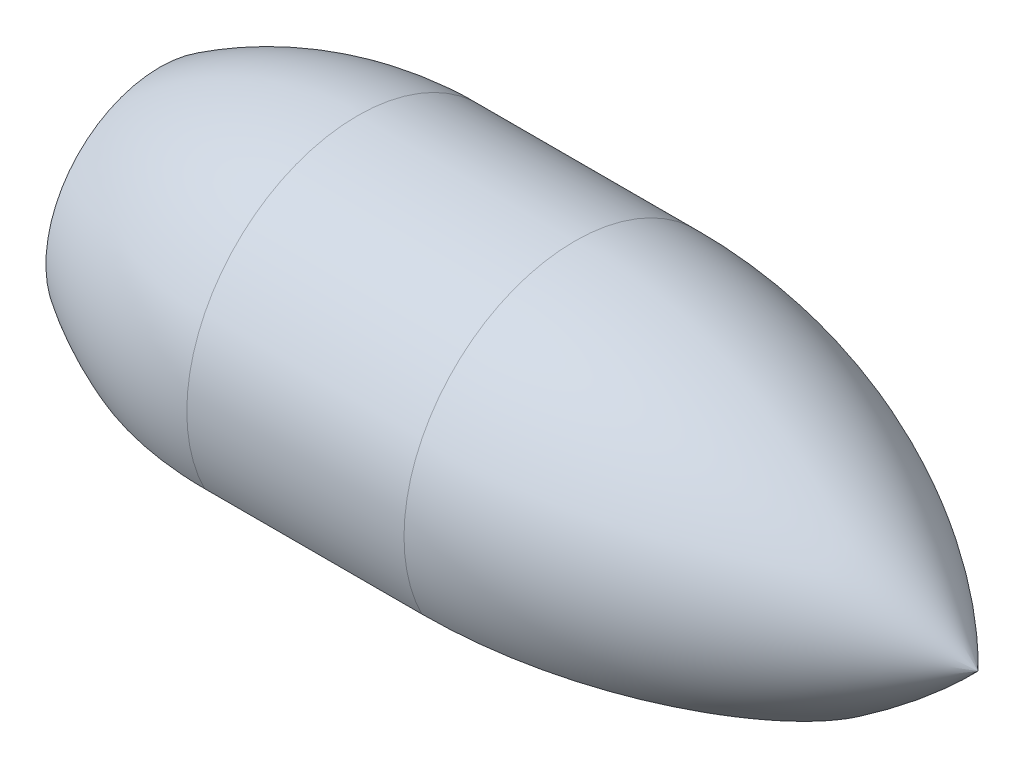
ISO-10303-21;
HEADER;
FILE_DESCRIPTION(('STEP AP214'),'2;1');
FILE_NAME('part.step','',(''),(''),'','','');
FILE_SCHEMA(('AUTOMOTIVE_DESIGN { 1 0 10303 214 1 1 1 1 }'));
ENDSEC;
DATA;
#1=APPLICATION_CONTEXT('core data for automotive mechanical design processes');
#2=APPLICATION_PROTOCOL_DEFINITION('international standard','automotive_design',2000,#1);
#3=PRODUCT_CONTEXT('',#1,'mechanical');
#4=PRODUCT('Part','Part','',(#3));
#5=PRODUCT_RELATED_PRODUCT_CATEGORY('part','',(#4));
#6=PRODUCT_DEFINITION_FORMATION('','',#4);
#7=PRODUCT_DEFINITION_CONTEXT('part definition',#1,'design');
#8=PRODUCT_DEFINITION('design','',#6,#7);
#9=PRODUCT_DEFINITION_SHAPE('','',#8);
#10=(LENGTH_UNIT() NAMED_UNIT(*) SI_UNIT(.MILLI.,.METRE.));
#11=(NAMED_UNIT(*) PLANE_ANGLE_UNIT() SI_UNIT($,.RADIAN.));
#12=(NAMED_UNIT(*) SI_UNIT($,.STERADIAN.) SOLID_ANGLE_UNIT());
#13=UNCERTAINTY_MEASURE_WITH_UNIT(LENGTH_MEASURE(1.E-05),#10,'distance_accuracy_value','');
#14=(GEOMETRIC_REPRESENTATION_CONTEXT(3) GLOBAL_UNCERTAINTY_ASSIGNED_CONTEXT((#13)) GLOBAL_UNIT_ASSIGNED_CONTEXT((#10,
#11,#12)) REPRESENTATION_CONTEXT('',''));
#15=CARTESIAN_POINT('',(0.,0.,0.));
#16=DIRECTION('',(0.,0.,1.));
#17=DIRECTION('',(1.,0.,0.));
#18=AXIS2_PLACEMENT_3D('',#15,#16,#17);
#19=CARTESIAN_POINT('',(87.63,0.,0.));
#20=DIRECTION('',(-1.,0.,0.));
#21=DIRECTION('',(0.,0.,1.));
#22=AXIS2_PLACEMENT_3D('',#19,#20,#21);
#23=CYLINDRICAL_SURFACE('',#22,18.288);
#24=CARTESIAN_POINT('',(44.45,0.,0.));
#25=DIRECTION('',(-1.,0.,0.));
#26=DIRECTION('',(0.,0.,1.));
#27=AXIS2_PLACEMENT_3D('',#24,#25,#26);
#28=CIRCLE('',#27,18.288);
#29=CARTESIAN_POINT('',(44.4499999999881,-8.10299076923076,16.3948920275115));
#30=VERTEX_POINT('',#29);
#31=CARTESIAN_POINT('',(44.45,-8.10299076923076,-16.3948920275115));
#32=VERTEX_POINT('',#31);
#33=EDGE_CURVE('E70',#30,#32,#28,.T.);
#34=ORIENTED_EDGE('',*,*,#33,.T.);
#35=DIRECTION('',(-1.,0.,0.));
#36=VECTOR('',#35,1.);
#37=CARTESIAN_POINT('',(87.63,-8.10299076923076,-16.3948920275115));
#38=LINE('',#37,#36);
#39=CARTESIAN_POINT('',(21.1848567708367,-8.10299076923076,-16.3948920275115));
#40=VERTEX_POINT('',#39);
#41=EDGE_CURVE('E46',#32,#40,#38,.T.);
#42=ORIENTED_EDGE('',*,*,#41,.T.);
#43=CARTESIAN_POINT('',(21.1848567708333,0.,0.));
#44=DIRECTION('',(-1.,0.,0.));
#45=DIRECTION('',(0.,0.,1.));
#46=AXIS2_PLACEMENT_3D('',#43,#44,#45);
#47=CIRCLE('',#46,18.288);
#48=CARTESIAN_POINT('',(21.1848567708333,-8.10299076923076,16.3948920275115));
#49=VERTEX_POINT('',#48);
#50=EDGE_CURVE('E72',#49,#40,#47,.T.);
#51=ORIENTED_EDGE('',*,*,#50,.F.);
#52=DIRECTION('',(-1.,0.,0.));
#53=VECTOR('',#52,1.);
#54=CARTESIAN_POINT('',(87.63,-8.10299076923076,16.3948920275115));
#55=LINE('',#54,#53);
#56=EDGE_CURVE('E63',#30,#49,#55,.T.);
#57=ORIENTED_EDGE('',*,*,#56,.F.);
#58=EDGE_LOOP('',(#34,#42,#51,#57));
#59=FACE_BOUND('',#58,.T.);
#60=ADVANCED_FACE('F29',(#59),#23,.T.);
#61=CARTESIAN_POINT('',(21.1848567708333,0.,0.));
#62=DIRECTION('',(-1.,0.,0.));
#63=DIRECTION('',(0.,0.,1.));
#64=AXIS2_PLACEMENT_3D('',#61,#62,#63);
#65=DEGENERATE_TOROIDAL_SURFACE('',#64,21.5708724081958,39.8588724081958,.F.);
#66=CARTESIAN_POINT('',(0.,0.,0.));
#67=DIRECTION('',(-1.,0.,0.));
#68=DIRECTION('',(0.,0.,1.));
#69=AXIS2_PLACEMENT_3D('',#66,#67,#68);
#70=CIRCLE('',#69,12.192);
#71=CARTESIAN_POINT('',(0.,-8.10299076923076,9.10968740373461));
#72=VERTEX_POINT('',#71);
#73=CARTESIAN_POINT('',(0.,-8.10299076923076,-9.10968740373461));
#74=VERTEX_POINT('',#73);
#75=EDGE_CURVE('E40',#72,#74,#70,.T.);
#76=ORIENTED_EDGE('',*,*,#75,.F.);
#77=CARTESIAN_POINT('',(-5.42701189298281,-8.10299076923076,0.));
#78=CARTESIAN_POINT('',(-5.42700869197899,-8.10299076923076,0.205943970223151));
#79=CARTESIAN_POINT('',(-5.4182286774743,-8.10299076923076,0.411912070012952));
#80=CARTESIAN_POINT('',(-5.38341209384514,-8.10299076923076,0.82238598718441));
#81=CARTESIAN_POINT('',(-5.35737311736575,-8.10299076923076,1.02689159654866));
#82=CARTESIAN_POINT('',(-5.28888127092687,-8.10299076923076,1.43331077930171));
#83=CARTESIAN_POINT('',(-5.24641336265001,-8.10299076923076,1.63522180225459));
#84=CARTESIAN_POINT('',(-5.14631975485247,-8.10299076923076,2.03532453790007));
#85=CARTESIAN_POINT('',(-5.0886857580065,-8.10299076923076,2.23351415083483));
#86=CARTESIAN_POINT('',(-4.92986401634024,-8.10299076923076,2.71615463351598));
#87=CARTESIAN_POINT('',(-4.82086706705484,-8.10299076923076,2.99804648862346));
#88=CARTESIAN_POINT('',(-4.57830886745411,-8.10299076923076,3.55093535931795));
#89=CARTESIAN_POINT('',(-4.44474329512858,-8.10299076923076,3.82193044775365));
#90=CARTESIAN_POINT('',(-4.15682521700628,-8.10299076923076,4.35356873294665));
#91=CARTESIAN_POINT('',(-4.00241383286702,-8.10299076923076,4.61417979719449));
#92=CARTESIAN_POINT('',(-3.6765710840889,-8.10299076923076,5.12444316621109));
#93=CARTESIAN_POINT('',(-3.50514049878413,-8.10299076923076,5.37409597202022));
#94=CARTESIAN_POINT('',(-3.16772446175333,-8.10299076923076,5.83588178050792));
#95=CARTESIAN_POINT('',(-3.00323105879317,-8.10299076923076,6.04911211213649));
#96=CARTESIAN_POINT('',(-2.66441800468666,-8.10299076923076,6.46764330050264));
#97=CARTESIAN_POINT('',(-2.49009705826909,-8.10299076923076,6.67294310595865));
#98=CARTESIAN_POINT('',(-2.13277019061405,-8.10299076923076,7.07602297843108));
#99=CARTESIAN_POINT('',(-1.94975957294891,-8.10299076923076,7.2737988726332));
#100=CARTESIAN_POINT('',(-1.5761058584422,-8.10299076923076,7.66201950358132));
#101=CARTESIAN_POINT('',(-1.38546187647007,-8.10299076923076,7.85246338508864));
#102=CARTESIAN_POINT('',(-0.802796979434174,-8.10299076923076,8.41368328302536));
#103=CARTESIAN_POINT('',(-0.400493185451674,-8.10299076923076,8.7738459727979));
#104=CARTESIAN_POINT('',(0.426390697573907,-8.10299076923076,9.4672616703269));
#105=CARTESIAN_POINT('',(0.850967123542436,-8.10299076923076,9.80051908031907));
#106=CARTESIAN_POINT('',(1.6306677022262,-8.10299076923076,10.3760317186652));
#107=CARTESIAN_POINT('',(1.98232910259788,-8.10299076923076,10.6229990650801));
#108=CARTESIAN_POINT('',(2.69634719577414,-8.10299076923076,11.100978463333));
#109=CARTESIAN_POINT('',(3.05870497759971,-8.10299076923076,11.3319888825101));
#110=CARTESIAN_POINT('',(4.16036174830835,-8.10299076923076,12.001637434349));
#111=CARTESIAN_POINT('',(4.91409083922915,-8.10299076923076,12.4167807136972));
#112=CARTESIAN_POINT('',(6.45232530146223,-8.10299076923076,13.1852948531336));
#113=CARTESIAN_POINT('',(7.23683596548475,-8.10299076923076,13.5386550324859));
#114=CARTESIAN_POINT('',(8.8305753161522,-8.10299076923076,14.1838785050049));
#115=CARTESIAN_POINT('',(9.63979993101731,-8.10299076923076,14.4757518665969));
#116=CARTESIAN_POINT('',(11.2993947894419,-8.10299076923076,15.0049256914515));
#117=CARTESIAN_POINT('',(12.1502873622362,-8.10299076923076,15.2405857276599));
#118=CARTESIAN_POINT('',(13.8674437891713,-8.10299076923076,15.6469948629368));
#119=CARTESIAN_POINT('',(14.7337083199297,-8.10299076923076,15.8177410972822));
#120=CARTESIAN_POINT('',(16.4761855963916,-8.10299076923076,16.0940344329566));
#121=CARTESIAN_POINT('',(17.3523938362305,-8.10299076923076,16.1996099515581));
#122=CARTESIAN_POINT('',(19.109892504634,-8.10299076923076,16.3455005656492));
#123=CARTESIAN_POINT('',(19.991181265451,-8.10299076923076,16.385835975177));
#124=CARTESIAN_POINT('',(21.8632161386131,-8.10299076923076,16.4021722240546));
#125=CARTESIAN_POINT('',(22.8540622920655,-8.10299076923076,16.3696288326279));
#126=CARTESIAN_POINT('',(24.3354358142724,-8.10299076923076,16.259118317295));
#127=CARTESIAN_POINT('',(24.8284550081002,-8.10299076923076,16.2119919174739));
#128=CARTESIAN_POINT('',(25.8122572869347,-8.10299076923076,16.0971798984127));
#129=CARTESIAN_POINT('',(26.3030396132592,-8.10299076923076,16.0294877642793));
#130=CARTESIAN_POINT('',(27.7728851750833,-8.10299076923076,15.7952274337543));
#131=CARTESIAN_POINT('',(28.7471778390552,-8.10299076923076,15.5976439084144));
#132=CARTESIAN_POINT('',(30.6753914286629,-8.10299076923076,15.1202378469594));
#133=CARTESIAN_POINT('',(31.6293136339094,-8.10299076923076,14.8404204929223));
#134=CARTESIAN_POINT('',(33.0417954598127,-8.10299076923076,14.3583468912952));
#135=CARTESIAN_POINT('',(33.5109442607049,-8.10299076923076,14.1866507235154));
#136=CARTESIAN_POINT('',(34.4409874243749,-8.10299076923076,13.8225742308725));
#137=CARTESIAN_POINT('',(34.9018837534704,-8.10299076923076,13.6301989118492));
#138=CARTESIAN_POINT('',(36.2714193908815,-8.10299076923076,13.0216387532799));
#139=CARTESIAN_POINT('',(37.166542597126,-8.10299076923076,12.5741428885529));
#140=CARTESIAN_POINT('',(38.4711520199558,-8.10299076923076,11.8412746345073));
#141=CARTESIAN_POINT('',(38.8986643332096,-8.10299076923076,11.5874183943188));
#142=CARTESIAN_POINT('',(39.7405142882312,-8.10299076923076,11.0585167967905));
#143=CARTESIAN_POINT('',(40.1548508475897,-8.10299076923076,10.7834697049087));
#144=CARTESIAN_POINT('',(40.9678790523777,-8.10299076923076,10.2121272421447));
#145=CARTESIAN_POINT('',(41.366588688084,-8.10299076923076,9.9158574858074));
#146=CARTESIAN_POINT('',(42.1464369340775,-8.10299076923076,9.30115924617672));
#147=CARTESIAN_POINT('',(42.5275811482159,-8.10299076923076,8.98273791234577));
#148=CARTESIAN_POINT('',(43.1495002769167,-8.10299076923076,8.4292297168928));
#149=CARTESIAN_POINT('',(43.3958747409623,-8.10299076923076,8.20041788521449));
#150=CARTESIAN_POINT('',(43.877841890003,-8.10299076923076,7.73173917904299));
#151=CARTESIAN_POINT('',(44.1134362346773,-8.10299076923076,7.4918740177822));
#152=CARTESIAN_POINT('',(44.5727130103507,-8.10299076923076,7.00004837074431));
#153=CARTESIAN_POINT('',(44.7963702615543,-8.10299076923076,6.74806429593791));
#154=CARTESIAN_POINT('',(45.2291322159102,-8.10299076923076,6.23182387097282));
#155=CARTESIAN_POINT('',(45.4382363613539,-8.10299076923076,5.96756705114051));
#156=CARTESIAN_POINT('',(45.8416829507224,-8.10299076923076,5.42259098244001));
#157=CARTESIAN_POINT('',(46.0357979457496,-8.10299076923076,5.14170228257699));
#158=CARTESIAN_POINT('',(46.4023792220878,-8.10299076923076,4.56592255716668));
#159=CARTESIAN_POINT('',(46.5748405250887,-8.10299076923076,4.27102833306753));
#160=CARTESIAN_POINT('',(46.8923842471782,-8.10299076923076,3.66818342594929));
#161=CARTESIAN_POINT('',(47.0375709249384,-8.10299076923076,3.36028820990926));
#162=CARTESIAN_POINT('',(47.2950875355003,-8.10299076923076,2.73107507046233));
#163=CARTESIAN_POINT('',(47.4074467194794,-8.10299076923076,2.40976939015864));
#164=CARTESIAN_POINT('',(47.5582993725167,-8.10299076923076,1.87718571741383));
#165=CARTESIAN_POINT('',(47.6087355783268,-8.10299076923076,1.66926094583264));
#166=CARTESIAN_POINT('',(47.6924365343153,-8.10299076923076,1.24997148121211));
#167=CARTESIAN_POINT('',(47.725704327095,-8.10299076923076,1.03860740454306));
#168=CARTESIAN_POINT('',(47.7738797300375,-8.10299076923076,0.614025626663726));
#169=CARTESIAN_POINT('',(47.7888082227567,-8.10299076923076,0.400810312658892));
#170=CARTESIAN_POINT('',(47.7998129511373,-8.10299076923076,-0.0261183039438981));
#171=CARTESIAN_POINT('',(47.7958886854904,-8.10299076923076,-0.239831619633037));
#172=CARTESIAN_POINT('',(47.7693496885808,-8.10299076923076,-0.665879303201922));
#173=CARTESIAN_POINT('',(47.746752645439,-8.10299076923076,-0.878214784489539));
#174=CARTESIAN_POINT('',(47.683722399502,-8.10299076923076,-1.30019717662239));
#175=CARTESIAN_POINT('',(47.6432890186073,-8.10299076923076,-1.50984406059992));
#176=CARTESIAN_POINT('',(47.5458526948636,-8.10299076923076,-1.9255399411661));
#177=CARTESIAN_POINT('',(47.488825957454,-8.10299076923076,-2.13158331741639));
#178=CARTESIAN_POINT('',(47.3598322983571,-8.10299076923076,-2.53896253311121));
#179=CARTESIAN_POINT('',(47.287860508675,-8.10299076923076,-2.7402968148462));
#180=CARTESIAN_POINT('',(47.0874156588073,-8.10299076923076,-3.24704383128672));
#181=CARTESIAN_POINT('',(46.9496394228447,-8.10299076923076,-3.5487906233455));
#182=CARTESIAN_POINT('',(46.6480621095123,-8.10299076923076,-4.13898166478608));
#183=CARTESIAN_POINT('',(46.4842458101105,-8.10299076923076,-4.42741800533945));
#184=CARTESIAN_POINT('',(46.1349756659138,-8.10299076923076,-4.99181692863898));
#185=CARTESIAN_POINT('',(45.9494667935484,-8.10299076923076,-5.26774521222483));
#186=CARTESIAN_POINT('',(45.5609288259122,-8.10299076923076,-5.80685881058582));
#187=CARTESIAN_POINT('',(45.3579011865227,-8.10299076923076,-6.07004518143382));
#188=CARTESIAN_POINT('',(44.9578109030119,-8.10299076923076,-6.55911202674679));
#189=CARTESIAN_POINT('',(44.762117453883,-8.10299076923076,-6.78611919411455));
#190=CARTESIAN_POINT('',(44.3603607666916,-8.10299076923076,-7.2308064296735));
#191=CARTESIAN_POINT('',(44.1542958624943,-8.10299076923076,-7.44848498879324));
#192=CARTESIAN_POINT('',(43.732989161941,-8.10299076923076,-7.87498332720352));
#193=CARTESIAN_POINT('',(43.5177425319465,-8.10299076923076,-8.08379832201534));
#194=CARTESIAN_POINT('',(43.0791755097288,-8.10299076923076,-8.49278767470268));
#195=CARTESIAN_POINT('',(42.8558542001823,-8.10299076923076,-8.69296104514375));
#196=CARTESIAN_POINT('',(42.1745311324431,-8.10299076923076,-9.28138513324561));
#197=CARTESIAN_POINT('',(41.7056221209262,-8.10299076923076,-9.65708739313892));
#198=CARTESIAN_POINT('',(40.7440910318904,-8.10299076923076,-10.3764059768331));
#199=CARTESIAN_POINT('',(40.251472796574,-8.10299076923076,-10.7200274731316));
#200=CARTESIAN_POINT('',(39.3720449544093,-8.10299076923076,-11.2940127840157));
#201=CARTESIAN_POINT('',(38.9896528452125,-8.10299076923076,-11.5311808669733));
#202=CARTESIAN_POINT('',(38.2147468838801,-8.10299076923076,-11.988354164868));
#203=CARTESIAN_POINT('',(37.822232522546,-8.10299076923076,-12.2083585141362));
#204=CARTESIAN_POINT('',(36.630865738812,-8.10299076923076,-12.8430284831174));
#205=CARTESIAN_POINT('',(35.8183210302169,-8.10299076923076,-13.2322658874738));
#206=CARTESIAN_POINT('',(34.164624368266,-8.10299076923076,-13.9432023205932));
#207=CARTESIAN_POINT('',(33.3234813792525,-8.10299076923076,-14.2649222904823));
#208=CARTESIAN_POINT('',(32.0447747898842,-8.10299076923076,-14.697019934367));
#209=CARTESIAN_POINT('',(31.6156005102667,-8.10299076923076,-14.8326656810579));
#210=CARTESIAN_POINT('',(30.7521904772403,-8.10299076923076,-15.0871324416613));
#211=CARTESIAN_POINT('',(30.3179536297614,-8.10299076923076,-15.2059497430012));
#212=CARTESIAN_POINT('',(28.9944376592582,-8.10299076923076,-15.5407093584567));
#213=CARTESIAN_POINT('',(28.0983439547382,-8.10299076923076,-15.7302352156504));
#214=CARTESIAN_POINT('',(26.2941586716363,-8.10299076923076,-16.0392282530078));
#215=CARTESIAN_POINT('',(25.3860667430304,-8.10299076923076,-16.1586933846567));
#216=CARTESIAN_POINT('',(24.0192290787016,-8.10299076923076,-16.2852083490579));
#217=CARTESIAN_POINT('',(23.5627919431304,-8.10299076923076,-16.3186001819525));
#218=CARTESIAN_POINT('',(22.6490775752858,-8.10299076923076,-16.3678102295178));
#219=CARTESIAN_POINT('',(22.1918005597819,-8.10299076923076,-16.3836324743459));
#220=CARTESIAN_POINT('',(20.8193257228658,-8.10299076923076,-16.4047370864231));
#221=CARTESIAN_POINT('',(19.9035887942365,-8.10299076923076,-16.383647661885));
#222=CARTESIAN_POINT('',(17.9933396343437,-8.10299076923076,-16.2660481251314));
#223=CARTESIAN_POINT('',(16.9992438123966,-8.10299076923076,-16.1628479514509));
#224=CARTESIAN_POINT('',(15.0234826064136,-8.10299076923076,-15.8729887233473));
#225=CARTESIAN_POINT('',(14.0418130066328,-8.10299076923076,-15.6863587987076));
#226=CARTESIAN_POINT('',(12.5836084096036,-8.10299076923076,-15.3440088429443));
#227=CARTESIAN_POINT('',(12.0995932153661,-8.10299076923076,-15.2193833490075));
#228=CARTESIAN_POINT('',(11.1374887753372,-8.10299076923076,-14.9493733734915));
#229=CARTESIAN_POINT('',(10.6593985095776,-8.10299076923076,-14.803992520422));
#230=CARTESIAN_POINT('',(9.23552292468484,-8.10299076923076,-14.3367717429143));
#231=CARTESIAN_POINT('',(8.29969600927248,-8.10299076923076,-13.9837514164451));
#232=CARTESIAN_POINT('',(6.68107931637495,-8.10299076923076,-13.2881128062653));
#233=CARTESIAN_POINT('',(5.99078510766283,-8.10299076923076,-12.9627763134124));
#234=CARTESIAN_POINT('',(4.63516578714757,-8.10299076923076,-12.2633276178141));
#235=CARTESIAN_POINT('',(3.96984324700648,-8.10299076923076,-11.8892104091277));
#236=CARTESIAN_POINT('',(2.67162316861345,-8.10299076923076,-11.0927300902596));
#237=CARTESIAN_POINT('',(2.03862251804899,-8.10299076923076,-10.6705363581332));
#238=CARTESIAN_POINT('',(1.11717895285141,-8.10299076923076,-9.99930711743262));
#239=CARTESIAN_POINT('',(0.814765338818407,-8.10299076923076,-9.7692910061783));
#240=CARTESIAN_POINT('',(0.220287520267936,-8.10299076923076,-9.29617025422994));
#241=CARTESIAN_POINT('',(-0.0717762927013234,-8.10299076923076,-9.05306511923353));
#242=CARTESIAN_POINT('',(-0.624456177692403,-8.10299076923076,-8.5705260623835));
#243=CARTESIAN_POINT('',(-0.885853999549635,-8.10299076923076,-8.33198819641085));
#244=CARTESIAN_POINT('',(-1.39696897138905,-8.10299076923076,-7.84277065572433));
#245=CARTESIAN_POINT('',(-1.64668838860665,-8.10299076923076,-7.59209335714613));
#246=CARTESIAN_POINT('',(-2.13337175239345,-8.10299076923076,-7.07722512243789));
#247=CARTESIAN_POINT('',(-2.37029666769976,-8.10299076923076,-6.81299715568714));
#248=CARTESIAN_POINT('',(-2.82818225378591,-8.10299076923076,-6.27098227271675));
#249=CARTESIAN_POINT('',(-3.04914271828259,-8.10299076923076,-5.99319518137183));
#250=CARTESIAN_POINT('',(-3.4751721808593,-8.10299076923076,-5.41880226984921));
#251=CARTESIAN_POINT('',(-3.67993738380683,-8.10299076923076,-5.12196954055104));
#252=CARTESIAN_POINT('',(-4.06514916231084,-8.10299076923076,-4.512617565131));
#253=CARTESIAN_POINT('',(-4.24558714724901,-8.10299076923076,-4.20009283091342));
#254=CARTESIAN_POINT('',(-4.57503886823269,-8.10299076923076,-3.56102229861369));
#255=CARTESIAN_POINT('',(-4.7242284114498,-8.10299076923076,-3.23456810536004));
#256=CARTESIAN_POINT('',(-4.98489704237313,-8.10299076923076,-2.56704441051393));
#257=CARTESIAN_POINT('',(-5.09642863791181,-8.10299076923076,-2.22599601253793));
#258=CARTESIAN_POINT('',(-5.2245168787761,-8.10299076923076,-1.72587155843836));
#259=CARTESIAN_POINT('',(-5.2593551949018,-8.10299076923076,-1.5713603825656));
#260=CARTESIAN_POINT('',(-5.31957112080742,-8.10299076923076,-1.26051996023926));
#261=CARTESIAN_POINT('',(-5.34495112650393,-8.10299076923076,-1.10419118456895));
#262=CARTESIAN_POINT('',(-5.38577117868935,-8.10299076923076,-0.790210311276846));
#263=CARTESIAN_POINT('',(-5.40120956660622,-8.10299076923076,-0.632557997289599));
#264=CARTESIAN_POINT('',(-5.42183045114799,-8.10299076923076,-0.316608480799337));
#265=CARTESIAN_POINT('',(-5.42701435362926,-8.10299076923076,-0.158311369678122));
#266=CARTESIAN_POINT('',(-5.42701189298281,-8.10299076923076,0.));
#267=B_SPLINE_CURVE_WITH_KNOTS('',3,(#77,#78,#79,#80,#81,#82,#83,#84,#85,#86,#87,#88,#89,#90,
#91,#92,#93,#94,#95,#96,#97,#98,#99,#100,#101,#102,#103,#104,#105,#106,#107,#108,#109,#110,#111,
#112,#113,#114,#115,#116,#117,#118,#119,#120,#121,#122,#123,#124,#125,#126,#127,#128,#129,#130,
#131,#132,#133,#134,#135,#136,#137,#138,#139,#140,#141,#142,#143,#144,#145,#146,#147,#148,#149,
#150,#151,#152,#153,#154,#155,#156,#157,#158,#159,#160,#161,#162,#163,#164,#165,#166,#167,#168,
#169,#170,#171,#172,#173,#174,#175,#176,#177,#178,#179,#180,#181,#182,#183,#184,#185,#186,#187,
#188,#189,#190,#191,#192,#193,#194,#195,#196,#197,#198,#199,#200,#201,#202,#203,#204,#205,#206,
#207,#208,#209,#210,#211,#212,#213,#214,#215,#216,#217,#218,#219,#220,#221,#222,#223,#224,#225,
#226,#227,#228,#229,#230,#231,#232,#233,#234,#235,#236,#237,#238,#239,#240,#241,#242,#243,#244,
#245,#246,#247,#248,#249,#250,#251,#252,#253,#254,#255,#256,#257,#258,#259,#260,#261,#262,#263,
#264,#265,#266),.UNSPECIFIED.,.T.,.F.,(4,2,2,2,2,2,2,2,2,2,2,2,2,2,2,2,2,2,2,2,2,2,2,2,2,2,2,2,
2,2,2,2,2,2,2,2,2,2,2,2,2,2,2,2,2,2,2,2,2,2,2,2,2,2,2,2,2,2,2,2,2,2,2,2,2,2,2,2,2,2,2,2,2,2,2,2,
2,2,2,2,2,2,2,2,2,2,2,2,2,2,2,2,2,2,4),(0.,0.617690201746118,1.23546657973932,1.85380978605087,
2.47249199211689,3.37770207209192,4.28307154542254,5.19105390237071,6.09899470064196,
6.90659332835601,7.71429864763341,8.5224455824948,9.33068649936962,10.9491849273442,
12.567417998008,13.8561274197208,15.1449685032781,17.7232186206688,20.3019140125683,
22.8801868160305,25.5263888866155,28.172707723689,30.8178718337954,33.4622121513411,
36.432548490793,37.9179829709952,39.4038885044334,42.3825038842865,45.3609316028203,
46.8592211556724,48.3571488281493,51.3541495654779,52.8452856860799,54.3365439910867,
55.8260318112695,57.3150411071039,58.3234475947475,59.3316983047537,60.341997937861,
61.35233626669,62.3758194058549,63.399537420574,64.4192588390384,65.4380688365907,
66.0793081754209,66.7204338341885,67.3608287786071,68.0012407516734,68.6410467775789,
69.280859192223,69.9215936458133,70.5625371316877,71.5560294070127,72.5501045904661,
73.5467585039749,74.5433296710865,75.44212243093,76.3410600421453,77.2404768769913,
78.1399962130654,79.9409482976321,81.7416095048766,83.0910692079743,84.4405969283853,
87.1401205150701,89.8388055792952,91.1888066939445,92.5391051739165,95.2838792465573,
98.0287335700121,99.4014078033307,100.77376710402,103.518800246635,106.513685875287,
109.507526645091,111.006525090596,112.505261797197,115.501393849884,117.789004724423,
120.076850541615,122.356871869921,123.496424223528,124.636019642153,125.697290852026,
126.758355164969,127.822492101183,128.886642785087,129.967492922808,131.048723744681,
132.123697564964,133.197166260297,133.672097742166,134.146908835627,134.621799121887,
135.096624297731),.UNSPECIFIED.);
#268=EDGE_CURVE('E91',#72,#49,#267,.T.);
#269=ORIENTED_EDGE('',*,*,#268,.T.);
#270=ORIENTED_EDGE('',*,*,#50,.T.);
#271=EDGE_CURVE('E51',#40,#74,#267,.T.);
#272=ORIENTED_EDGE('',*,*,#271,.T.);
#273=EDGE_LOOP('',(#76,#269,#270,#272));
#274=FACE_BOUND('',#273,.T.);
#275=ADVANCED_FACE('F90',(#274),#65,.F.);
#276=CARTESIAN_POINT('',(0.,0.,0.));
#277=DIRECTION('',(1.,0.,0.));
#278=DIRECTION('',(0.,0.,-1.));
#279=AXIS2_PLACEMENT_3D('',#276,#277,#278);
#280=PLANE('',#279);
#281=CARTESIAN_POINT('',(0.,0.,0.));
#282=DIRECTION('',(-1.,0.,0.));
#283=DIRECTION('',(0.,0.,1.));
#284=AXIS2_PLACEMENT_3D('',#281,#282,#283);
#285=CIRCLE('',#284,7.9375);
#286=CARTESIAN_POINT('',(0.,0.,7.9375));
#287=VERTEX_POINT('',#286);
#288=EDGE_CURVE('E93',#287,#287,#285,.T.);
#289=ORIENTED_EDGE('',*,*,#288,.F.);
#290=EDGE_LOOP('',(#289));
#291=FACE_BOUND('',#290,.T.);
#292=ORIENTED_EDGE('',*,*,#75,.T.);
#293=DIRECTION('',(0.,0.,-1.));
#294=VECTOR('',#293,1.);
#295=CARTESIAN_POINT('',(0.,-8.10299076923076,16.3948920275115));
#296=LINE('',#295,#294);
#297=EDGE_CURVE('E73',#72,#74,#296,.T.);
#298=ORIENTED_EDGE('',*,*,#297,.F.);
#299=EDGE_LOOP('',(#292,#298));
#300=FACE_BOUND('',#299,.T.);
#301=ADVANCED_FACE('F88',(#291,#300),#280,.F.);
#302=CARTESIAN_POINT('',(44.45,0.,0.));
#303=DIRECTION('',(-1.,0.,0.));
#304=DIRECTION('',(0.,0.,1.));
#305=AXIS2_PLACEMENT_3D('',#302,#303,#304);
#306=DEGENERATE_TOROIDAL_SURFACE('',#305,41.8524678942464,60.1404678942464,.F.);
#307=CARTESIAN_POINT('',(77.9362364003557,-8.10299076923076,0.));
#308=CARTESIAN_POINT('',(77.9362404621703,-8.10299076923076,0.172813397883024));
#309=CARTESIAN_POINT('',(77.9279615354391,-8.10299076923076,0.345608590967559));
#310=CARTESIAN_POINT('',(77.8951998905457,-8.10299076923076,0.689708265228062));
#311=CARTESIAN_POINT('',(77.8707115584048,-8.10299076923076,0.861012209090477));
#312=CARTESIAN_POINT('',(77.8064399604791,-8.10299076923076,1.20096515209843));
#313=CARTESIAN_POINT('',(77.7666336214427,-8.10299076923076,1.369609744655));
#314=CARTESIAN_POINT('',(77.6731031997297,-8.10299076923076,1.70305657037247));
#315=CARTESIAN_POINT('',(77.6193708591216,-8.10299076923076,1.86785646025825));
#316=CARTESIAN_POINT('',(77.4773033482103,-8.10299076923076,2.25331748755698));
#317=CARTESIAN_POINT('',(77.383529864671,-8.10299076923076,2.47197521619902));
#318=CARTESIAN_POINT('',(77.1768384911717,-8.10299076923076,2.89999829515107));
#319=CARTESIAN_POINT('',(77.0639132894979,-8.10299076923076,3.10936005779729));
#320=CARTESIAN_POINT('',(76.8221912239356,-8.10299076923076,3.5193433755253));
#321=CARTESIAN_POINT('',(76.6933551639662,-8.10299076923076,3.71994162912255));
#322=CARTESIAN_POINT('',(76.4229727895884,-8.10299076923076,4.1122768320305));
#323=CARTESIAN_POINT('',(76.2814279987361,-8.10299076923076,4.30401483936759));
#324=CARTESIAN_POINT('',(75.9897825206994,-8.10299076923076,4.67688612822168));
#325=CARTESIAN_POINT('',(75.8398143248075,-8.10299076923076,4.85812363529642));
#326=CARTESIAN_POINT('',(75.5314234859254,-8.10299076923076,5.21322393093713));
#327=CARTESIAN_POINT('',(75.3730008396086,-8.10299076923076,5.38708671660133));
#328=CARTESIAN_POINT('',(75.0489005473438,-8.10299076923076,5.7281650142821));
#329=CARTESIAN_POINT('',(74.8832170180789,-8.10299076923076,5.89537491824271));
#330=CARTESIAN_POINT('',(74.5457418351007,-8.10299076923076,6.22352769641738));
#331=CARTESIAN_POINT('',(74.3739494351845,-8.10299076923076,6.38446979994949));
#332=CARTESIAN_POINT('',(73.8500106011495,-8.10299076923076,6.85920514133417));
#333=CARTESIAN_POINT('',(73.4899226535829,-8.10299076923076,7.16426548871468));
#334=CARTESIAN_POINT('',(72.7536581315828,-8.10299076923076,7.75383377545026));
#335=CARTESIAN_POINT('',(72.3774868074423,-8.10299076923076,8.03834834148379));
#336=CARTESIAN_POINT('',(71.5775861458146,-8.10299076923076,8.61384629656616));
#337=CARTESIAN_POINT('',(71.1526222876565,-8.10299076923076,8.90311017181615));
#338=CARTESIAN_POINT('',(70.2898402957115,-8.10299076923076,9.46188841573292));
#339=CARTESIAN_POINT('',(69.8520195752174,-8.10299076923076,9.73139877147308));
#340=CARTESIAN_POINT('',(68.9652416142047,-8.10299076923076,10.252191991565));
#341=CARTESIAN_POINT('',(68.5162760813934,-8.10299076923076,10.5034607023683));
#342=CARTESIAN_POINT('',(67.6090109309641,-8.10299076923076,10.9885472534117));
#343=CARTESIAN_POINT('',(67.1507108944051,-8.10299076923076,11.2223643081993));
#344=CARTESIAN_POINT('',(66.2255442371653,-8.10299076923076,11.6734651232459));
#345=CARTESIAN_POINT('',(65.7586703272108,-8.10299076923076,11.8907339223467));
#346=CARTESIAN_POINT('',(64.8177338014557,-8.10299076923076,12.3090240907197));
#347=CARTESIAN_POINT('',(64.343671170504,-8.10299076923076,12.5100454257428));
#348=CARTESIAN_POINT('',(62.9121659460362,-8.10299076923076,13.0892535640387));
#349=CARTESIAN_POINT('',(61.9450179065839,-8.10299076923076,13.4437723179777));
#350=CARTESIAN_POINT('',(60.2722644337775,-8.10299076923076,13.9981757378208));
#351=CARTESIAN_POINT('',(59.5715845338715,-8.10299076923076,14.2131846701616));
#352=CARTESIAN_POINT('',(58.1615548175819,-8.10299076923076,14.612591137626));
#353=CARTESIAN_POINT('',(57.4522053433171,-8.10299076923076,14.7969898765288));
#354=CARTESIAN_POINT('',(56.0260988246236,-8.10299076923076,15.1355166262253));
#355=CARTESIAN_POINT('',(55.3093395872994,-8.10299076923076,15.2896353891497));
#356=CARTESIAN_POINT('',(53.8698807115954,-8.10299076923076,15.5677447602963));
#357=CARTESIAN_POINT('',(53.1471797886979,-8.10299076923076,15.691728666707));
#358=CARTESIAN_POINT('',(50.9717874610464,-8.10299076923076,16.018689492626));
#359=CARTESIAN_POINT('',(49.5120876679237,-8.10299076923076,16.1766091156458));
#360=CARTESIAN_POINT('',(46.5846681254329,-8.10299076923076,16.3726233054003));
#361=CARTESIAN_POINT('',(45.1169481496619,-8.10299076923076,16.410714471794));
#362=CARTESIAN_POINT('',(42.9110450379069,-8.10299076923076,16.3779958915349));
#363=CARTESIAN_POINT('',(42.1719771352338,-8.10299076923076,16.3518184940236));
#364=CARTESIAN_POINT('',(40.6957326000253,-8.10299076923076,16.2690423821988));
#365=CARTESIAN_POINT('',(39.9585555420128,-8.10299076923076,16.2124512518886));
#366=CARTESIAN_POINT('',(37.7520730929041,-8.10299076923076,15.9970462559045));
#367=CARTESIAN_POINT('',(36.2869780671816,-8.10299076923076,15.7925884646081));
#368=CARTESIAN_POINT('',(33.3819873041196,-8.10299076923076,15.2617893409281));
#369=CARTESIAN_POINT('',(31.9420463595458,-8.10299076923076,14.9356968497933));
#370=CARTESIAN_POINT('',(29.808040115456,-8.10299076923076,14.3540463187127));
#371=CARTESIAN_POINT('',(29.1011126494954,-8.10299076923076,14.1447774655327));
#372=CARTESIAN_POINT('',(27.6973147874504,-8.10299076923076,13.6949495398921));
#373=CARTESIAN_POINT('',(27.0004431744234,-8.10299076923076,13.4543942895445));
#374=CARTESIAN_POINT('',(25.6387615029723,-8.10299076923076,12.9488841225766));
#375=CARTESIAN_POINT('',(24.9736100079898,-8.10299076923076,12.6848493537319));
#376=CARTESIAN_POINT('',(23.6565241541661,-8.10299076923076,12.1259011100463));
#377=CARTESIAN_POINT('',(23.0045875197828,-8.10299076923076,11.8309930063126));
#378=CARTESIAN_POINT('',(21.7151658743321,-8.10299076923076,11.2084596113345));
#379=CARTESIAN_POINT('',(21.07770515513,-8.10299076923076,10.8807836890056));
#380=CARTESIAN_POINT('',(20.1357328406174,-8.10299076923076,10.3635741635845));
#381=CARTESIAN_POINT('',(19.8241230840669,-8.10299076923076,10.1868953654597));
#382=CARTESIAN_POINT('',(19.2061564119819,-8.10299076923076,9.82459144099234));
#383=CARTESIAN_POINT('',(18.8997994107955,-8.10299076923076,9.63896646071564));
#384=CARTESIAN_POINT('',(18.1203302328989,-8.10299076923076,9.15007428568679));
#385=CARTESIAN_POINT('',(17.6514699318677,-8.10299076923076,8.83994061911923));
#386=CARTESIAN_POINT('',(16.9614644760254,-8.10299076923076,8.35566063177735));
#387=CARTESIAN_POINT('',(16.7336161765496,-8.10299076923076,8.19100629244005));
#388=CARTESIAN_POINT('',(16.2829591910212,-8.10299076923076,7.85495008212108));
#389=CARTESIAN_POINT('',(16.0601501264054,-8.10299076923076,7.6835487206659));
#390=CARTESIAN_POINT('',(15.6210839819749,-8.10299076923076,7.33418085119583));
#391=CARTESIAN_POINT('',(15.40480559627,-8.10299076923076,7.15624116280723));
#392=CARTESIAN_POINT('',(14.9788499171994,-8.10299076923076,6.79265581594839));
#393=CARTESIAN_POINT('',(14.7691718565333,-8.10299076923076,6.607011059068));
#394=CARTESIAN_POINT('',(14.3577098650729,-8.10299076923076,6.22747808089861));
#395=CARTESIAN_POINT('',(14.155919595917,-8.10299076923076,6.03359675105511));
#396=CARTESIAN_POINT('',(13.7615932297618,-8.10299076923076,5.63668460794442));
#397=CARTESIAN_POINT('',(13.5690548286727,-8.10299076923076,5.43365609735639));
#398=CARTESIAN_POINT('',(13.2400265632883,-8.10299076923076,5.06737266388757));
#399=CARTESIAN_POINT('',(13.1011648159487,-8.10299076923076,4.90624994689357));
#400=CARTESIAN_POINT('',(12.8310861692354,-8.10299076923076,4.57770285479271));
#401=CARTESIAN_POINT('',(12.6998689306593,-8.10299076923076,4.41027875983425));
#402=CARTESIAN_POINT('',(12.4463119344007,-8.10299076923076,4.068397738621));
#403=CARTESIAN_POINT('',(12.3239864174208,-8.10299076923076,3.89393019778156));
#404=CARTESIAN_POINT('',(12.0902403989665,-8.10299076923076,3.53778240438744));
#405=CARTESIAN_POINT('',(11.9788203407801,-8.10299076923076,3.3561018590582));
#406=CARTESIAN_POINT('',(11.7674859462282,-8.10299076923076,2.98238119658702));
#407=CARTESIAN_POINT('',(11.6677765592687,-8.10299076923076,2.79022420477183));
#408=CARTESIAN_POINT('',(11.4846658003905,-8.10299076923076,2.39820101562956));
#409=CARTESIAN_POINT('',(11.4012651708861,-8.10299076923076,2.19833446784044));
#410=CARTESIAN_POINT('',(11.2541414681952,-8.10299076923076,1.79223305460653));
#411=CARTESIAN_POINT('',(11.1903476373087,-8.10299076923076,1.58602411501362));
#412=CARTESIAN_POINT('',(11.0850955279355,-8.10299076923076,1.1679856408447));
#413=CARTESIAN_POINT('',(11.0436253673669,-8.10299076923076,0.956159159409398));
#414=CARTESIAN_POINT('',(10.9930671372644,-8.10299076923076,0.585743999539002));
#415=CARTESIAN_POINT('',(10.9783114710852,-8.10299076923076,0.427914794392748));
#416=CARTESIAN_POINT('',(10.962610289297,-8.10299076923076,0.111580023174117));
#417=CARTESIAN_POINT('',(10.961662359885,-8.10299076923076,-0.0469254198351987));
#418=CARTESIAN_POINT('',(10.9736158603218,-8.10299076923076,-0.363458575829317));
#419=CARTESIAN_POINT('',(10.9865217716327,-8.10299076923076,-0.521486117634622));
#420=CARTESIAN_POINT('',(11.0257356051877,-8.10299076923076,-0.835871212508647));
#421=CARTESIAN_POINT('',(11.052045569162,-8.10299076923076,-0.992228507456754));
#422=CARTESIAN_POINT('',(11.124451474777,-8.10299076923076,-1.33662191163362));
#423=CARTESIAN_POINT('',(11.1736376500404,-8.10299076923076,-1.52401072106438));
#424=CARTESIAN_POINT('',(11.2887050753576,-8.10299076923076,-1.89354439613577));
#425=CARTESIAN_POINT('',(11.3545907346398,-8.10299076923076,-2.07568786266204));
#426=CARTESIAN_POINT('',(11.5742162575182,-8.10299076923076,-2.61390434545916));
#427=CARTESIAN_POINT('',(11.7497819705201,-8.10299076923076,-2.96114601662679));
#428=CARTESIAN_POINT('',(12.1152269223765,-8.10299076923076,-3.58429982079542));
#429=CARTESIAN_POINT('',(12.299808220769,-8.10299076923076,-3.86345065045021));
#430=CARTESIAN_POINT('',(12.6923034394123,-8.10299076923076,-4.40507716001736));
#431=CARTESIAN_POINT('',(12.9002361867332,-8.10299076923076,-4.66753911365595));
#432=CARTESIAN_POINT('',(13.3343124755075,-8.10299076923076,-5.17786191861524));
#433=CARTESIAN_POINT('',(13.5604987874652,-8.10299076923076,-5.42568597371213));
#434=CARTESIAN_POINT('',(14.0267466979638,-8.10299076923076,-5.90771323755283));
#435=CARTESIAN_POINT('',(14.2668048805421,-8.10299076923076,-6.14191977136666));
#436=CARTESIAN_POINT('',(14.7847199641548,-8.10299076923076,-6.62290813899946));
#437=CARTESIAN_POINT('',(15.0638557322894,-8.10299076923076,-6.86830726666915));
#438=CARTESIAN_POINT('',(15.633318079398,-8.10299076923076,-7.34582725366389));
#439=CARTESIAN_POINT('',(15.9236472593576,-8.10299076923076,-7.57794499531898));
#440=CARTESIAN_POINT('',(16.5138358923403,-8.10299076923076,-8.03025855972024));
#441=CARTESIAN_POINT('',(16.8137037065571,-8.10299076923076,-8.25044343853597));
#442=CARTESIAN_POINT('',(17.4213108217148,-8.10299076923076,-8.67958862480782));
#443=CARTESIAN_POINT('',(17.7290495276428,-8.10299076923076,-8.88854977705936));
#444=CARTESIAN_POINT('',(18.3519432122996,-8.10299076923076,-9.2963719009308));
#445=CARTESIAN_POINT('',(18.6671107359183,-8.10299076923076,-9.49521368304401));
#446=CARTESIAN_POINT('',(19.3034878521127,-8.10299076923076,-9.88294742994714));
#447=CARTESIAN_POINT('',(19.6246974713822,-8.10299076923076,-10.0718393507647));
#448=CARTESIAN_POINT('',(20.5961522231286,-8.10299076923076,-10.6241621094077));
#449=CARTESIAN_POINT('',(21.2545079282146,-8.10299076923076,-10.9734245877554));
#450=CARTESIAN_POINT('',(22.5198332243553,-8.10299076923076,-11.6023691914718));
#451=CARTESIAN_POINT('',(23.1250982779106,-8.10299076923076,-11.8855123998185));
#452=CARTESIAN_POINT('',(24.3477133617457,-8.10299076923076,-12.4245805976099));
#453=CARTESIAN_POINT('',(24.9650648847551,-8.10299076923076,-12.6805021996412));
#454=CARTESIAN_POINT('',(26.2103952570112,-8.10299076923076,-13.1660107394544));
#455=CARTESIAN_POINT('',(26.8383794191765,-8.10299076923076,-13.3955840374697));
#456=CARTESIAN_POINT('',(28.1032501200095,-8.10299076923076,-13.8287948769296));
#457=CARTESIAN_POINT('',(28.7401377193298,-8.10299076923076,-14.0324292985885));
#458=CARTESIAN_POINT('',(30.6611473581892,-8.10299076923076,-14.604657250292));
#459=CARTESIAN_POINT('',(31.9569261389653,-8.10299076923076,-14.9350822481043));
#460=CARTESIAN_POINT('',(33.9160123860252,-8.10299076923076,-15.3552815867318));
#461=CARTESIAN_POINT('',(34.5715596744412,-8.10299076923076,-15.4827680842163));
#462=CARTESIAN_POINT('',(35.8871764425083,-8.10299076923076,-15.7127922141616));
#463=CARTESIAN_POINT('',(36.5472468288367,-8.10299076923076,-15.815324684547));
#464=CARTESIAN_POINT('',(38.571316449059,-8.10299076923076,-16.090830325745));
#465=CARTESIAN_POINT('',(39.9409886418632,-8.10299076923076,-16.2235110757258));
#466=CARTESIAN_POINT('',(42.686486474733,-8.10299076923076,-16.3836102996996));
#467=CARTESIAN_POINT('',(44.0623122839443,-8.10299076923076,-16.4110258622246));
#468=CARTESIAN_POINT('',(46.126467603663,-8.10299076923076,-16.3732331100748));
#469=CARTESIAN_POINT('',(46.8157048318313,-8.10299076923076,-16.3473767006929));
#470=CARTESIAN_POINT('',(48.1925245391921,-8.10299076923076,-16.2691993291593));
#471=CARTESIAN_POINT('',(48.8801073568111,-8.10299076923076,-16.2168843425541));
#472=CARTESIAN_POINT('',(50.9389807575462,-8.10299076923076,-16.0202055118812));
#473=CARTESIAN_POINT('',(52.3066504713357,-8.10299076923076,-15.8361031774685));
#474=CARTESIAN_POINT('',(55.1606334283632,-8.10299076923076,-15.3374388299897));
#475=CARTESIAN_POINT('',(56.6450043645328,-8.10299076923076,-15.0115940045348));
#476=CARTESIAN_POINT('',(58.8456179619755,-8.10299076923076,-14.4247064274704));
#477=CARTESIAN_POINT('',(59.5752002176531,-8.10299076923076,-14.212589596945));
#478=CARTESIAN_POINT('',(61.0239259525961,-8.10299076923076,-13.7551524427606));
#479=CARTESIAN_POINT('',(61.7430697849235,-8.10299076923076,-13.5098332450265));
#480=CARTESIAN_POINT('',(63.1645879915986,-8.10299076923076,-12.9869472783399));
#481=CARTESIAN_POINT('',(63.8670377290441,-8.10299076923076,-12.7095855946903));
#482=CARTESIAN_POINT('',(65.2574725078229,-8.10299076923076,-12.1203985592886));
#483=CARTESIAN_POINT('',(65.9454555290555,-8.10299076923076,-11.8085684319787));
#484=CARTESIAN_POINT('',(67.3030430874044,-8.10299076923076,-11.1494211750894));
#485=CARTESIAN_POINT('',(67.9726739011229,-8.10299076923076,-10.8021585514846));
#486=CARTESIAN_POINT('',(68.9609930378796,-8.10299076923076,-10.252650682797));
#487=CARTESIAN_POINT('',(69.2877024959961,-8.10299076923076,-10.064739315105));
#488=CARTESIAN_POINT('',(69.9351476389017,-8.10299076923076,-9.67890940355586));
#489=CARTESIAN_POINT('',(70.2558837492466,-8.10299076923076,-9.48099157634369));
#490=CARTESIAN_POINT('',(70.8831193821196,-8.10299076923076,-9.07939144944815));
#491=CARTESIAN_POINT('',(71.1897762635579,-8.10299076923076,-8.87595521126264));
#492=CARTESIAN_POINT('',(71.7956938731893,-8.10299076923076,-8.45837672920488));
#493=CARTESIAN_POINT('',(72.0949551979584,-8.10299076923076,-8.24423535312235));
#494=CARTESIAN_POINT('',(72.6855727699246,-8.10299076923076,-7.80388095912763));
#495=CARTESIAN_POINT('',(72.9769089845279,-8.10299076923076,-7.57764098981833));
#496=CARTESIAN_POINT('',(73.5492871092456,-8.10299076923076,-7.1124703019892));
#497=CARTESIAN_POINT('',(73.8303294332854,-8.10299076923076,-6.87354009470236));
#498=CARTESIAN_POINT('',(74.3825497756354,-8.10299076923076,-6.37917034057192));
#499=CARTESIAN_POINT('',(74.6536045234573,-8.10299076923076,-6.12359225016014));
#500=CARTESIAN_POINT('',(75.1796829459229,-8.10299076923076,-5.59611596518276));
#501=CARTESIAN_POINT('',(75.4346993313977,-8.10299076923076,-5.32421045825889));
#502=CARTESIAN_POINT('',(75.9229785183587,-8.10299076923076,-4.7627399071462));
#503=CARTESIAN_POINT('',(76.1563073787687,-8.10299076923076,-4.47323325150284));
#504=CARTESIAN_POINT('',(76.4849504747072,-8.10299076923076,-4.02360163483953));
#505=CARTESIAN_POINT('',(76.5908939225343,-8.10299076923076,-3.87123955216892));
#506=CARTESIAN_POINT('',(76.7944805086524,-8.10299076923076,-3.56108058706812));
#507=CARTESIAN_POINT('',(76.8921227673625,-8.10299076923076,-3.40328313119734));
#508=CARTESIAN_POINT('',(77.1688768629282,-8.10299076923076,-2.92410963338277));
#509=CARTESIAN_POINT('',(77.3339131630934,-8.10299076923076,-2.59416102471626));
#510=CARTESIAN_POINT('',(77.5420583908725,-8.10299076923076,-2.08380992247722));
#511=CARTESIAN_POINT('',(77.6048257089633,-8.10299076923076,-1.9113145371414));
#512=CARTESIAN_POINT('',(77.7154464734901,-8.10299076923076,-1.56162709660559));
#513=CARTESIAN_POINT('',(77.7633069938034,-8.10299076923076,-1.38443731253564));
#514=CARTESIAN_POINT('',(77.8464845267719,-8.10299076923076,-1.00765480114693));
#515=CARTESIAN_POINT('',(77.8799739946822,-8.10299076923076,-0.807652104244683));
#516=CARTESIAN_POINT('',(77.9248499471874,-8.10299076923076,-0.405091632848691));
#517=CARTESIAN_POINT('',(77.9362316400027,-8.10299076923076,-0.202533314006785));
#518=CARTESIAN_POINT('',(77.9362364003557,-8.10299076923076,0.));
#519=B_SPLINE_CURVE_WITH_KNOTS('',3,(#307,#308,#309,#310,#311,#312,#313,#314,#315,#316,#317,
#318,#319,#320,#321,#322,#323,#324,#325,#326,#327,#328,#329,#330,#331,#332,#333,#334,#335,#336,
#337,#338,#339,#340,#341,#342,#343,#344,#345,#346,#347,#348,#349,#350,#351,#352,#353,#354,#355,
#356,#357,#358,#359,#360,#361,#362,#363,#364,#365,#366,#367,#368,#369,#370,#371,#372,#373,#374,
#375,#376,#377,#378,#379,#380,#381,#382,#383,#384,#385,#386,#387,#388,#389,#390,#391,#392,#393,
#394,#395,#396,#397,#398,#399,#400,#401,#402,#403,#404,#405,#406,#407,#408,#409,#410,#411,#412,
#413,#414,#415,#416,#417,#418,#419,#420,#421,#422,#423,#424,#425,#426,#427,#428,#429,#430,#431,
#432,#433,#434,#435,#436,#437,#438,#439,#440,#441,#442,#443,#444,#445,#446,#447,#448,#449,#450,
#451,#452,#453,#454,#455,#456,#457,#458,#459,#460,#461,#462,#463,#464,#465,#466,#467,#468,#469,
#470,#471,#472,#473,#474,#475,#476,#477,#478,#479,#480,#481,#482,#483,#484,#485,#486,#487,#488,
#489,#490,#491,#492,#493,#494,#495,#496,#497,#498,#499,#500,#501,#502,#503,#504,#505,#506,#507,
#508,#509,#510,#511,#512,#513,#514,#515,#516,#517,#518),.UNSPECIFIED.,.T.,.F.,(4,2,2,2,2,2,2,2,
2,2,2,2,2,2,2,2,2,2,2,2,2,2,2,2,2,2,2,2,2,2,2,2,2,2,2,2,2,2,2,2,2,2,2,2,2,2,2,2,2,2,2,2,2,2,2,2,
2,2,2,2,2,2,2,2,2,2,2,2,2,2,2,2,2,2,2,2,2,2,2,2,2,2,2,2,2,2,2,2,2,2,2,2,2,2,2,2,2,2,2,2,2,2,2,2,
2,4),(0.,0.51821535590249,1.03661028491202,1.55578913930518,2.07527656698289,2.78784293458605,
3.50068195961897,4.21531345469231,4.92985939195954,5.6352717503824,6.34068438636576,
7.04667956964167,7.75276128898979,9.16759652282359,10.5819733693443,12.1235536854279,
13.6654463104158,15.2085227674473,16.7516686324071,18.2961934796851,19.8407215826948,
22.9284868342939,25.1266552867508,27.3247372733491,29.5234895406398,31.7227303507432,
36.1220759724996,40.5215464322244,42.7395889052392,44.9570785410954,49.3895502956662,
53.8130033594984,56.024153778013,58.235034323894,60.3812094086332,62.5270117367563,
64.6761824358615,65.7506885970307,66.825177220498,68.5107491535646,69.3539976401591,
70.1971825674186,71.0372281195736,71.8771756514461,72.7164337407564,73.5554817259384,
74.1933995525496,74.8312890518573,75.470178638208,76.1090941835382,76.7579061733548,
77.4067476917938,78.0532193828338,78.6993466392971,79.1743380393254,79.6492464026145,
80.1243084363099,80.5994428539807,81.1797299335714,81.7601703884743,82.9229281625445,
83.9256110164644,84.9291081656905,85.9350290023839,86.9407031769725,88.0552293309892,
89.1700160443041,90.285808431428,91.4015167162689,92.5192674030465,93.6370230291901,
95.871517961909,97.8755204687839,99.8797720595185,101.885056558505,103.890582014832,
107.897431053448,109.900546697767,111.904076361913,116.027990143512,120.152017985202,
122.220740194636,124.288995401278,128.424745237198,132.977514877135,135.25624258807,
137.534893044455,139.799692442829,142.064806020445,144.326486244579,145.457025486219,
146.587483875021,147.691279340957,148.794985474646,149.90126195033,151.00749389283,
152.124538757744,153.242087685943,154.356112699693,154.912589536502,155.469125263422,
156.571774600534,157.121921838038,157.671807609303,158.279012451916,158.886348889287),.UNSPECIFIED.);
#520=EDGE_CURVE('E11',#32,#30,#519,.T.);
#521=ORIENTED_EDGE('',*,*,#520,.F.);
#522=ORIENTED_EDGE('',*,*,#33,.F.);
#523=EDGE_LOOP('',(#521,#522));
#524=FACE_BOUND('',#523,.T.);
#525=CARTESIAN_POINT('',(87.63,0.,0.));
#526=DIRECTION('',(-1.,0.,0.));
#527=DIRECTION('',(0.,0.,1.));
#528=AXIS2_PLACEMENT_3D('',#525,#526,#527);
#529=CIRCLE('',#528,0.00877287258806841);
#530=CARTESIAN_POINT('',(87.63,0.,0.00877287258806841));
#531=VERTEX_POINT('',#530);
#532=EDGE_CURVE('E77',#531,#531,#529,.T.);
#533=ORIENTED_EDGE('',*,*,#532,.T.);
#534=EDGE_LOOP('',(#533));
#535=FACE_BOUND('',#534,.T.);
#536=ADVANCED_FACE('F75',(#524,#535),#306,.F.);
#537=CARTESIAN_POINT('',(87.63,0.,0.));
#538=DIRECTION('',(1.,0.,0.));
#539=DIRECTION('',(0.,0.,-1.));
#540=AXIS2_PLACEMENT_3D('',#537,#538,#539);
#541=PLANE('',#540);
#542=ORIENTED_EDGE('',*,*,#532,.F.);
#543=EDGE_LOOP('',(#542));
#544=FACE_BOUND('',#543,.T.);
#545=ADVANCED_FACE('F111',(#544),#541,.T.);
#546=CARTESIAN_POINT('',(24.13,0.,0.));
#547=DIRECTION('',(-1.,0.,0.));
#548=DIRECTION('',(0.,0.,1.));
#549=AXIS2_PLACEMENT_3D('',#546,#547,#548);
#550=CYLINDRICAL_SURFACE('',#549,7.9375);
#551=CARTESIAN_POINT('',(24.13,0.,0.));
#552=DIRECTION('',(-1.,0.,0.));
#553=DIRECTION('',(0.,0.,1.));
#554=AXIS2_PLACEMENT_3D('',#551,#552,#553);
#555=CIRCLE('',#554,7.9375);
#556=CARTESIAN_POINT('',(24.13,0.,7.9375));
#557=VERTEX_POINT('',#556);
#558=EDGE_CURVE('E81',#557,#557,#555,.T.);
#559=ORIENTED_EDGE('',*,*,#558,.F.);
#560=EDGE_LOOP('',(#559));
#561=FACE_BOUND('',#560,.T.);
#562=ORIENTED_EDGE('',*,*,#288,.T.);
#563=EDGE_LOOP('',(#562));
#564=FACE_BOUND('',#563,.T.);
#565=ADVANCED_FACE('F108',(#561,#564),#550,.F.);
#566=CARTESIAN_POINT('',(24.13,0.,0.));
#567=DIRECTION('',(-1.,0.,0.));
#568=DIRECTION('',(0.,0.,1.));
#569=AXIS2_PLACEMENT_3D('',#566,#567,#568);
#570=PLANE('',#569);
#571=ORIENTED_EDGE('',*,*,#558,.T.);
#572=EDGE_LOOP('',(#571));
#573=FACE_BOUND('',#572,.T.);
#574=ADVANCED_FACE('F104',(#573),#570,.T.);
#575=CARTESIAN_POINT('',(87.63,-8.10299076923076,16.3948920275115));
#576=DIRECTION('',(0.,1.,0.));
#577=DIRECTION('',(0.,0.,1.));
#578=AXIS2_PLACEMENT_3D('',#575,#576,#577);
#579=PLANE('',#578);
#580=ORIENTED_EDGE('',*,*,#297,.T.);
#581=ORIENTED_EDGE('',*,*,#271,.F.);
#582=ORIENTED_EDGE('',*,*,#41,.F.);
#583=ORIENTED_EDGE('',*,*,#520,.T.);
#584=ORIENTED_EDGE('',*,*,#56,.T.);
#585=ORIENTED_EDGE('',*,*,#268,.F.);
#586=EDGE_LOOP('',(#580,#581,#582,#583,#584,#585));
#587=FACE_BOUND('',#586,.T.);
#588=ADVANCED_FACE('F62',(#587),#579,.F.);
#589=CLOSED_SHELL('',(#60,#275,#301,#536,#545,#565,#574,#588));
#590=MANIFOLD_SOLID_BREP('B2',#589);
#591=ADVANCED_BREP_SHAPE_REPRESENTATION('',(#18,#590),#14);
#592=SHAPE_DEFINITION_REPRESENTATION(#9,#591);
ENDSEC;
END-ISO-10303-21;
